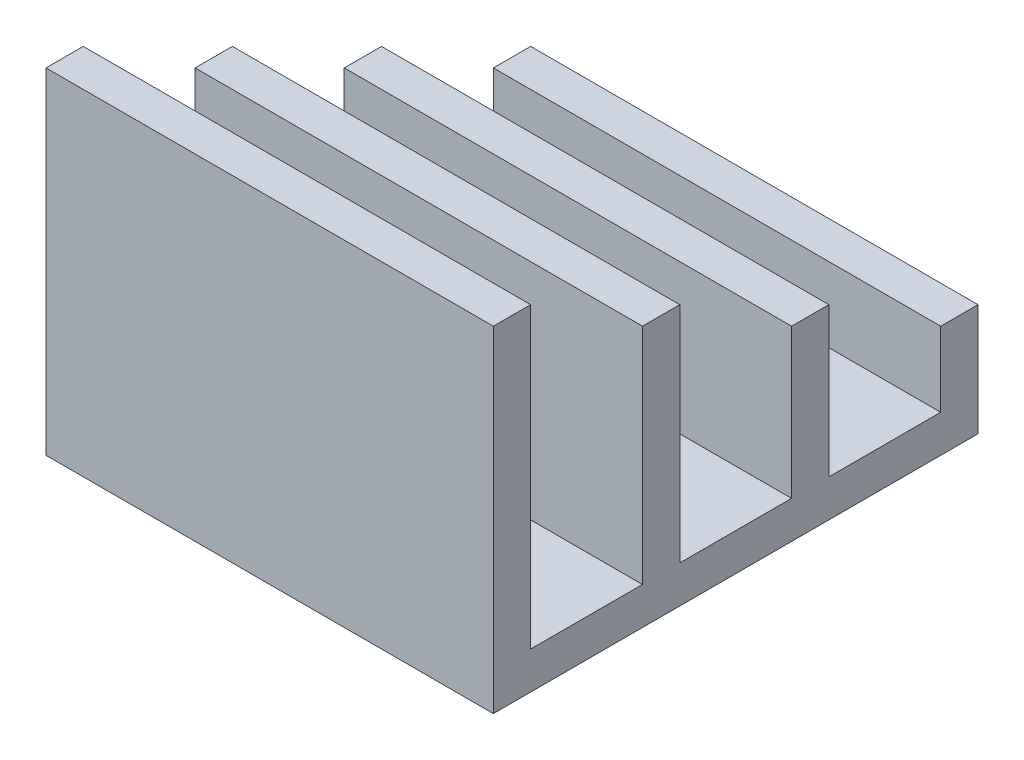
ISO-10303-21;
HEADER;
FILE_DESCRIPTION(('STEP AP214'),'2;1');
FILE_NAME('part.step','',(''),(''),'','','');
FILE_SCHEMA(('AUTOMOTIVE_DESIGN { 1 0 10303 214 1 1 1 1 }'));
ENDSEC;
DATA;
#1=APPLICATION_CONTEXT('core data for automotive mechanical design processes');
#2=APPLICATION_PROTOCOL_DEFINITION('international standard','automotive_design',2000,#1);
#3=PRODUCT_CONTEXT('',#1,'mechanical');
#4=PRODUCT('Part','Part','',(#3));
#5=PRODUCT_RELATED_PRODUCT_CATEGORY('part','',(#4));
#6=PRODUCT_DEFINITION_FORMATION('','',#4);
#7=PRODUCT_DEFINITION_CONTEXT('part definition',#1,'design');
#8=PRODUCT_DEFINITION('design','',#6,#7);
#9=PRODUCT_DEFINITION_SHAPE('','',#8);
#10=(LENGTH_UNIT() NAMED_UNIT(*) SI_UNIT(.MILLI.,.METRE.));
#11=(NAMED_UNIT(*) PLANE_ANGLE_UNIT() SI_UNIT($,.RADIAN.));
#12=(NAMED_UNIT(*) SI_UNIT($,.STERADIAN.) SOLID_ANGLE_UNIT());
#13=UNCERTAINTY_MEASURE_WITH_UNIT(LENGTH_MEASURE(1.E-05),#10,'distance_accuracy_value','');
#14=(GEOMETRIC_REPRESENTATION_CONTEXT(3) GLOBAL_UNCERTAINTY_ASSIGNED_CONTEXT((#13)) GLOBAL_UNIT_ASSIGNED_CONTEXT((#10,
#11,#12)) REPRESENTATION_CONTEXT('',''));
#15=CARTESIAN_POINT('',(0.,0.,0.));
#16=DIRECTION('',(0.,0.,1.));
#17=DIRECTION('',(1.,0.,0.));
#18=AXIS2_PLACEMENT_3D('',#15,#16,#17);
#19=CARTESIAN_POINT('',(152.4,0.,-165.1));
#20=DIRECTION('',(0.,1.,0.));
#21=DIRECTION('',(0.,0.,1.));
#22=AXIS2_PLACEMENT_3D('',#19,#20,#21);
#23=PLANE('',#22);
#24=DIRECTION('',(0.,0.,-1.));
#25=VECTOR('',#24,1.);
#26=CARTESIAN_POINT('',(0.,0.,-165.1));
#27=LINE('',#26,#25);
#28=CARTESIAN_POINT('',(0.,0.,0.));
#29=VERTEX_POINT('',#28);
#30=CARTESIAN_POINT('',(0.,0.,-165.1));
#31=VERTEX_POINT('',#30);
#32=EDGE_CURVE('E181',#29,#31,#27,.T.);
#33=ORIENTED_EDGE('',*,*,#32,.T.);
#34=DIRECTION('',(-1.,0.,0.));
#35=VECTOR('',#34,1.);
#36=CARTESIAN_POINT('',(152.4,0.,-165.1));
#37=LINE('',#36,#35);
#38=CARTESIAN_POINT('',(152.4,0.,-165.1));
#39=VERTEX_POINT('',#38);
#40=EDGE_CURVE('E11',#39,#31,#37,.T.);
#41=ORIENTED_EDGE('',*,*,#40,.F.);
#42=DIRECTION('',(0.,0.,-1.));
#43=VECTOR('',#42,1.);
#44=CARTESIAN_POINT('',(152.4,0.,-165.1));
#45=LINE('',#44,#43);
#46=CARTESIAN_POINT('',(152.4,0.,0.));
#47=VERTEX_POINT('',#46);
#48=EDGE_CURVE('E211',#47,#39,#45,.T.);
#49=ORIENTED_EDGE('',*,*,#48,.F.);
#50=DIRECTION('',(-1.,0.,0.));
#51=VECTOR('',#50,1.);
#52=CARTESIAN_POINT('',(152.4,0.,0.));
#53=LINE('',#52,#51);
#54=EDGE_CURVE('E177',#47,#29,#53,.T.);
#55=ORIENTED_EDGE('',*,*,#54,.T.);
#56=EDGE_LOOP('',(#33,#41,#49,#55));
#57=FACE_BOUND('',#56,.T.);
#58=ADVANCED_FACE('F37',(#57),#23,.F.);
#59=CARTESIAN_POINT('',(152.4,38.1,-165.1));
#60=DIRECTION('',(0.,0.,1.));
#61=DIRECTION('',(0.,-1.,0.));
#62=AXIS2_PLACEMENT_3D('',#59,#60,#61);
#63=PLANE('',#62);
#64=DIRECTION('',(0.,1.,0.));
#65=VECTOR('',#64,1.);
#66=CARTESIAN_POINT('',(0.,38.1,-165.1));
#67=LINE('',#66,#65);
#68=CARTESIAN_POINT('',(0.,38.1,-165.1));
#69=VERTEX_POINT('',#68);
#70=EDGE_CURVE('E184',#31,#69,#67,.T.);
#71=ORIENTED_EDGE('',*,*,#70,.T.);
#72=DIRECTION('',(-1.,0.,0.));
#73=VECTOR('',#72,1.);
#74=CARTESIAN_POINT('',(152.4,38.1,-165.1));
#75=LINE('',#74,#73);
#76=CARTESIAN_POINT('',(152.4,38.1,-165.1));
#77=VERTEX_POINT('',#76);
#78=EDGE_CURVE('E45',#77,#69,#75,.T.);
#79=ORIENTED_EDGE('',*,*,#78,.F.);
#80=DIRECTION('',(0.,1.,0.));
#81=VECTOR('',#80,1.);
#82=CARTESIAN_POINT('',(152.4,38.1,-165.1));
#83=LINE('',#82,#81);
#84=EDGE_CURVE('E120',#39,#77,#83,.T.);
#85=ORIENTED_EDGE('',*,*,#84,.F.);
#86=ORIENTED_EDGE('',*,*,#40,.T.);
#87=EDGE_LOOP('',(#71,#79,#85,#86));
#88=FACE_BOUND('',#87,.T.);
#89=ADVANCED_FACE('F309',(#88),#63,.F.);
#90=CARTESIAN_POINT('',(152.4,38.1,-152.4));
#91=DIRECTION('',(0.,-1.,0.));
#92=DIRECTION('',(0.,0.,-1.));
#93=AXIS2_PLACEMENT_3D('',#90,#91,#92);
#94=PLANE('',#93);
#95=DIRECTION('',(0.,0.,1.));
#96=VECTOR('',#95,1.);
#97=CARTESIAN_POINT('',(0.,38.1,-152.4));
#98=LINE('',#97,#96);
#99=CARTESIAN_POINT('',(0.,38.1,-152.4));
#100=VERTEX_POINT('',#99);
#101=EDGE_CURVE('E186',#69,#100,#98,.T.);
#102=ORIENTED_EDGE('',*,*,#101,.T.);
#103=DIRECTION('',(-1.,0.,0.));
#104=VECTOR('',#103,1.);
#105=CARTESIAN_POINT('',(152.4,38.1,-152.4));
#106=LINE('',#105,#104);
#107=CARTESIAN_POINT('',(152.4,38.1,-152.4));
#108=VERTEX_POINT('',#107);
#109=EDGE_CURVE('E242',#108,#100,#106,.T.);
#110=ORIENTED_EDGE('',*,*,#109,.F.);
#111=DIRECTION('',(0.,0.,1.));
#112=VECTOR('',#111,1.);
#113=CARTESIAN_POINT('',(152.4,38.1,-152.4));
#114=LINE('',#113,#112);
#115=EDGE_CURVE('E250',#77,#108,#114,.T.);
#116=ORIENTED_EDGE('',*,*,#115,.F.);
#117=ORIENTED_EDGE('',*,*,#78,.T.);
#118=EDGE_LOOP('',(#102,#110,#116,#117));
#119=FACE_BOUND('',#118,.T.);
#120=ADVANCED_FACE('F248',(#119),#94,.F.);
#121=CARTESIAN_POINT('',(152.4,12.7,-152.4));
#122=DIRECTION('',(0.,0.,-1.));
#123=DIRECTION('',(0.,1.,0.));
#124=AXIS2_PLACEMENT_3D('',#121,#122,#123);
#125=PLANE('',#124);
#126=DIRECTION('',(0.,-1.,0.));
#127=VECTOR('',#126,1.);
#128=CARTESIAN_POINT('',(0.,12.7,-152.4));
#129=LINE('',#128,#127);
#130=CARTESIAN_POINT('',(0.,12.7,-152.4));
#131=VERTEX_POINT('',#130);
#132=EDGE_CURVE('E188',#100,#131,#129,.T.);
#133=ORIENTED_EDGE('',*,*,#132,.T.);
#134=DIRECTION('',(-1.,0.,0.));
#135=VECTOR('',#134,1.);
#136=CARTESIAN_POINT('',(152.4,12.7,-152.4));
#137=LINE('',#136,#135);
#138=CARTESIAN_POINT('',(152.4,12.7,-152.4));
#139=VERTEX_POINT('',#138);
#140=EDGE_CURVE('E239',#139,#131,#137,.T.);
#141=ORIENTED_EDGE('',*,*,#140,.F.);
#142=DIRECTION('',(0.,-1.,0.));
#143=VECTOR('',#142,1.);
#144=CARTESIAN_POINT('',(152.4,12.7,-152.4));
#145=LINE('',#144,#143);
#146=EDGE_CURVE('E268',#108,#139,#145,.T.);
#147=ORIENTED_EDGE('',*,*,#146,.F.);
#148=ORIENTED_EDGE('',*,*,#109,.T.);
#149=EDGE_LOOP('',(#133,#141,#147,#148));
#150=FACE_BOUND('',#149,.T.);
#151=ADVANCED_FACE('F259',(#150),#125,.F.);
#152=CARTESIAN_POINT('',(152.4,12.7,-114.3));
#153=DIRECTION('',(0.,-1.,0.));
#154=DIRECTION('',(0.,0.,-1.));
#155=AXIS2_PLACEMENT_3D('',#152,#153,#154);
#156=PLANE('',#155);
#157=DIRECTION('',(0.,0.,1.));
#158=VECTOR('',#157,1.);
#159=CARTESIAN_POINT('',(0.,12.7,-114.3));
#160=LINE('',#159,#158);
#161=CARTESIAN_POINT('',(0.,12.7,-114.3));
#162=VERTEX_POINT('',#161);
#163=EDGE_CURVE('E190',#131,#162,#160,.T.);
#164=ORIENTED_EDGE('',*,*,#163,.T.);
#165=DIRECTION('',(-1.,0.,0.));
#166=VECTOR('',#165,1.);
#167=CARTESIAN_POINT('',(152.4,12.7,-114.3));
#168=LINE('',#167,#166);
#169=CARTESIAN_POINT('',(152.4,12.7,-114.3));
#170=VERTEX_POINT('',#169);
#171=EDGE_CURVE('E236',#170,#162,#168,.T.);
#172=ORIENTED_EDGE('',*,*,#171,.F.);
#173=DIRECTION('',(0.,0.,1.));
#174=VECTOR('',#173,1.);
#175=CARTESIAN_POINT('',(152.4,12.7,-114.3));
#176=LINE('',#175,#174);
#177=EDGE_CURVE('E265',#139,#170,#176,.T.);
#178=ORIENTED_EDGE('',*,*,#177,.F.);
#179=ORIENTED_EDGE('',*,*,#140,.T.);
#180=EDGE_LOOP('',(#164,#172,#178,#179));
#181=FACE_BOUND('',#180,.T.);
#182=ADVANCED_FACE('F263',(#181),#156,.F.);
#183=CARTESIAN_POINT('',(152.4,63.5,-114.3));
#184=DIRECTION('',(0.,0.,1.));
#185=DIRECTION('',(0.,-1.,0.));
#186=AXIS2_PLACEMENT_3D('',#183,#184,#185);
#187=PLANE('',#186);
#188=DIRECTION('',(0.,1.,0.));
#189=VECTOR('',#188,1.);
#190=CARTESIAN_POINT('',(0.,63.5,-114.3));
#191=LINE('',#190,#189);
#192=CARTESIAN_POINT('',(0.,63.5,-114.3));
#193=VERTEX_POINT('',#192);
#194=EDGE_CURVE('E192',#162,#193,#191,.T.);
#195=ORIENTED_EDGE('',*,*,#194,.T.);
#196=DIRECTION('',(-1.,0.,0.));
#197=VECTOR('',#196,1.);
#198=CARTESIAN_POINT('',(152.4,63.5,-114.3));
#199=LINE('',#198,#197);
#200=CARTESIAN_POINT('',(152.4,63.5,-114.3));
#201=VERTEX_POINT('',#200);
#202=EDGE_CURVE('E233',#201,#193,#199,.T.);
#203=ORIENTED_EDGE('',*,*,#202,.F.);
#204=DIRECTION('',(0.,1.,0.));
#205=VECTOR('',#204,1.);
#206=CARTESIAN_POINT('',(152.4,63.5,-114.3));
#207=LINE('',#206,#205);
#208=EDGE_CURVE('E267',#170,#201,#207,.T.);
#209=ORIENTED_EDGE('',*,*,#208,.F.);
#210=ORIENTED_EDGE('',*,*,#171,.T.);
#211=EDGE_LOOP('',(#195,#203,#209,#210));
#212=FACE_BOUND('',#211,.T.);
#213=ADVANCED_FACE('F322',(#212),#187,.F.);
#214=CARTESIAN_POINT('',(152.4,63.5,-101.6));
#215=DIRECTION('',(0.,-1.,0.));
#216=DIRECTION('',(0.,0.,-1.));
#217=AXIS2_PLACEMENT_3D('',#214,#215,#216);
#218=PLANE('',#217);
#219=DIRECTION('',(0.,0.,1.));
#220=VECTOR('',#219,1.);
#221=CARTESIAN_POINT('',(0.,63.5,-101.6));
#222=LINE('',#221,#220);
#223=CARTESIAN_POINT('',(0.,63.5,-101.6));
#224=VERTEX_POINT('',#223);
#225=EDGE_CURVE('E194',#193,#224,#222,.T.);
#226=ORIENTED_EDGE('',*,*,#225,.T.);
#227=DIRECTION('',(-1.,0.,0.));
#228=VECTOR('',#227,1.);
#229=CARTESIAN_POINT('',(152.4,63.5,-101.6));
#230=LINE('',#229,#228);
#231=CARTESIAN_POINT('',(152.4,63.5,-101.6));
#232=VERTEX_POINT('',#231);
#233=EDGE_CURVE('E230',#232,#224,#230,.T.);
#234=ORIENTED_EDGE('',*,*,#233,.F.);
#235=DIRECTION('',(0.,0.,1.));
#236=VECTOR('',#235,1.);
#237=CARTESIAN_POINT('',(152.4,63.5,-101.6));
#238=LINE('',#237,#236);
#239=EDGE_CURVE('E270',#201,#232,#238,.T.);
#240=ORIENTED_EDGE('',*,*,#239,.F.);
#241=ORIENTED_EDGE('',*,*,#202,.T.);
#242=EDGE_LOOP('',(#226,#234,#240,#241));
#243=FACE_BOUND('',#242,.T.);
#244=ADVANCED_FACE('F325',(#243),#218,.F.);
#245=CARTESIAN_POINT('',(152.4,12.7,-101.6));
#246=DIRECTION('',(0.,0.,-1.));
#247=DIRECTION('',(-1.,0.,0.));
#248=AXIS2_PLACEMENT_3D('',#245,#246,#247);
#249=PLANE('',#248);
#250=DIRECTION('',(0.,-1.,0.));
#251=VECTOR('',#250,1.);
#252=CARTESIAN_POINT('',(0.,12.7,-101.6));
#253=LINE('',#252,#251);
#254=CARTESIAN_POINT('',(0.,12.7,-101.6));
#255=VERTEX_POINT('',#254);
#256=EDGE_CURVE('E196',#224,#255,#253,.T.);
#257=ORIENTED_EDGE('',*,*,#256,.T.);
#258=DIRECTION('',(-1.,0.,0.));
#259=VECTOR('',#258,1.);
#260=CARTESIAN_POINT('',(152.4,12.7,-101.6));
#261=LINE('',#260,#259);
#262=CARTESIAN_POINT('',(152.4,12.7,-101.6));
#263=VERTEX_POINT('',#262);
#264=EDGE_CURVE('E227',#263,#255,#261,.T.);
#265=ORIENTED_EDGE('',*,*,#264,.F.);
#266=DIRECTION('',(0.,-1.,0.));
#267=VECTOR('',#266,1.);
#268=CARTESIAN_POINT('',(152.4,12.7,-101.6));
#269=LINE('',#268,#267);
#270=EDGE_CURVE('E276',#232,#263,#269,.T.);
#271=ORIENTED_EDGE('',*,*,#270,.F.);
#272=ORIENTED_EDGE('',*,*,#233,.T.);
#273=EDGE_LOOP('',(#257,#265,#271,#272));
#274=FACE_BOUND('',#273,.T.);
#275=ADVANCED_FACE('F329',(#274),#249,.F.);
#276=CARTESIAN_POINT('',(152.4,12.7,-63.5));
#277=DIRECTION('',(0.,-1.,0.));
#278=DIRECTION('',(0.,0.,-1.));
#279=AXIS2_PLACEMENT_3D('',#276,#277,#278);
#280=PLANE('',#279);
#281=DIRECTION('',(0.,0.,1.));
#282=VECTOR('',#281,1.);
#283=CARTESIAN_POINT('',(0.,12.7,-63.5));
#284=LINE('',#283,#282);
#285=CARTESIAN_POINT('',(0.,12.7,-63.5));
#286=VERTEX_POINT('',#285);
#287=EDGE_CURVE('E198',#255,#286,#284,.T.);
#288=ORIENTED_EDGE('',*,*,#287,.T.);
#289=DIRECTION('',(-1.,0.,0.));
#290=VECTOR('',#289,1.);
#291=CARTESIAN_POINT('',(152.4,12.7,-63.5));
#292=LINE('',#291,#290);
#293=CARTESIAN_POINT('',(152.4,12.7,-63.5));
#294=VERTEX_POINT('',#293);
#295=EDGE_CURVE('E224',#294,#286,#292,.T.);
#296=ORIENTED_EDGE('',*,*,#295,.F.);
#297=DIRECTION('',(0.,0.,1.));
#298=VECTOR('',#297,1.);
#299=CARTESIAN_POINT('',(152.4,12.7,-63.5));
#300=LINE('',#299,#298);
#301=EDGE_CURVE('E278',#263,#294,#300,.T.);
#302=ORIENTED_EDGE('',*,*,#301,.F.);
#303=ORIENTED_EDGE('',*,*,#264,.T.);
#304=EDGE_LOOP('',(#288,#296,#302,#303));
#305=FACE_BOUND('',#304,.T.);
#306=ADVANCED_FACE('F333',(#305),#280,.F.);
#307=CARTESIAN_POINT('',(152.4,88.9,-63.5));
#308=DIRECTION('',(0.,0.,1.));
#309=DIRECTION('',(0.,-1.,0.));
#310=AXIS2_PLACEMENT_3D('',#307,#308,#309);
#311=PLANE('',#310);
#312=DIRECTION('',(0.,1.,0.));
#313=VECTOR('',#312,1.);
#314=CARTESIAN_POINT('',(0.,88.9,-63.5));
#315=LINE('',#314,#313);
#316=CARTESIAN_POINT('',(0.,88.9,-63.5));
#317=VERTEX_POINT('',#316);
#318=EDGE_CURVE('E200',#286,#317,#315,.T.);
#319=ORIENTED_EDGE('',*,*,#318,.T.);
#320=DIRECTION('',(-1.,0.,0.));
#321=VECTOR('',#320,1.);
#322=CARTESIAN_POINT('',(152.4,88.9,-63.5));
#323=LINE('',#322,#321);
#324=CARTESIAN_POINT('',(152.4,88.9,-63.5));
#325=VERTEX_POINT('',#324);
#326=EDGE_CURVE('E221',#325,#317,#323,.T.);
#327=ORIENTED_EDGE('',*,*,#326,.F.);
#328=DIRECTION('',(0.,1.,0.));
#329=VECTOR('',#328,1.);
#330=CARTESIAN_POINT('',(152.4,88.9,-63.5));
#331=LINE('',#330,#329);
#332=EDGE_CURVE('E280',#294,#325,#331,.T.);
#333=ORIENTED_EDGE('',*,*,#332,.F.);
#334=ORIENTED_EDGE('',*,*,#295,.T.);
#335=EDGE_LOOP('',(#319,#327,#333,#334));
#336=FACE_BOUND('',#335,.T.);
#337=ADVANCED_FACE('F337',(#336),#311,.F.);
#338=CARTESIAN_POINT('',(152.4,88.9,-50.8));
#339=DIRECTION('',(0.,-1.,0.));
#340=DIRECTION('',(0.,0.,-1.));
#341=AXIS2_PLACEMENT_3D('',#338,#339,#340);
#342=PLANE('',#341);
#343=DIRECTION('',(0.,0.,1.));
#344=VECTOR('',#343,1.);
#345=CARTESIAN_POINT('',(0.,88.9,-50.8));
#346=LINE('',#345,#344);
#347=CARTESIAN_POINT('',(0.,88.9,-50.8));
#348=VERTEX_POINT('',#347);
#349=EDGE_CURVE('E202',#317,#348,#346,.T.);
#350=ORIENTED_EDGE('',*,*,#349,.T.);
#351=DIRECTION('',(-1.,0.,0.));
#352=VECTOR('',#351,1.);
#353=CARTESIAN_POINT('',(152.4,88.9,-50.8));
#354=LINE('',#353,#352);
#355=CARTESIAN_POINT('',(152.4,88.9,-50.8));
#356=VERTEX_POINT('',#355);
#357=EDGE_CURVE('E218',#356,#348,#354,.T.);
#358=ORIENTED_EDGE('',*,*,#357,.F.);
#359=DIRECTION('',(0.,0.,1.));
#360=VECTOR('',#359,1.);
#361=CARTESIAN_POINT('',(152.4,88.9,-50.8));
#362=LINE('',#361,#360);
#363=EDGE_CURVE('E282',#325,#356,#362,.T.);
#364=ORIENTED_EDGE('',*,*,#363,.F.);
#365=ORIENTED_EDGE('',*,*,#326,.T.);
#366=EDGE_LOOP('',(#350,#358,#364,#365));
#367=FACE_BOUND('',#366,.T.);
#368=ADVANCED_FACE('F341',(#367),#342,.F.);
#369=CARTESIAN_POINT('',(152.4,12.7,-50.8));
#370=DIRECTION('',(0.,0.,-1.));
#371=DIRECTION('',(-1.,0.,0.));
#372=AXIS2_PLACEMENT_3D('',#369,#370,#371);
#373=PLANE('',#372);
#374=DIRECTION('',(0.,-1.,0.));
#375=VECTOR('',#374,1.);
#376=CARTESIAN_POINT('',(0.,12.7,-50.8));
#377=LINE('',#376,#375);
#378=CARTESIAN_POINT('',(0.,12.7,-50.8));
#379=VERTEX_POINT('',#378);
#380=EDGE_CURVE('E204',#348,#379,#377,.T.);
#381=ORIENTED_EDGE('',*,*,#380,.T.);
#382=DIRECTION('',(-1.,0.,0.));
#383=VECTOR('',#382,1.);
#384=CARTESIAN_POINT('',(152.4,12.7,-50.8));
#385=LINE('',#384,#383);
#386=CARTESIAN_POINT('',(152.4,12.7,-50.8));
#387=VERTEX_POINT('',#386);
#388=EDGE_CURVE('E215',#387,#379,#385,.T.);
#389=ORIENTED_EDGE('',*,*,#388,.F.);
#390=DIRECTION('',(0.,-1.,0.));
#391=VECTOR('',#390,1.);
#392=CARTESIAN_POINT('',(152.4,12.7,-50.8));
#393=LINE('',#392,#391);
#394=EDGE_CURVE('E284',#356,#387,#393,.T.);
#395=ORIENTED_EDGE('',*,*,#394,.F.);
#396=ORIENTED_EDGE('',*,*,#357,.T.);
#397=EDGE_LOOP('',(#381,#389,#395,#396));
#398=FACE_BOUND('',#397,.T.);
#399=ADVANCED_FACE('F290',(#398),#373,.F.);
#400=CARTESIAN_POINT('',(152.4,12.7,-12.7));
#401=DIRECTION('',(0.,-1.,0.));
#402=DIRECTION('',(0.,0.,-1.));
#403=AXIS2_PLACEMENT_3D('',#400,#401,#402);
#404=PLANE('',#403);
#405=DIRECTION('',(0.,0.,1.));
#406=VECTOR('',#405,1.);
#407=CARTESIAN_POINT('',(0.,12.7,-12.7));
#408=LINE('',#407,#406);
#409=CARTESIAN_POINT('',(0.,12.7,-12.7));
#410=VERTEX_POINT('',#409);
#411=EDGE_CURVE('E206',#379,#410,#408,.T.);
#412=ORIENTED_EDGE('',*,*,#411,.T.);
#413=DIRECTION('',(-1.,0.,0.));
#414=VECTOR('',#413,1.);
#415=CARTESIAN_POINT('',(152.4,12.7,-12.7));
#416=LINE('',#415,#414);
#417=CARTESIAN_POINT('',(152.4,12.7,-12.7));
#418=VERTEX_POINT('',#417);
#419=EDGE_CURVE('E172',#418,#410,#416,.T.);
#420=ORIENTED_EDGE('',*,*,#419,.F.);
#421=DIRECTION('',(0.,0.,1.));
#422=VECTOR('',#421,1.);
#423=CARTESIAN_POINT('',(152.4,12.7,-12.7));
#424=LINE('',#423,#422);
#425=EDGE_CURVE('E163',#387,#418,#424,.T.);
#426=ORIENTED_EDGE('',*,*,#425,.F.);
#427=ORIENTED_EDGE('',*,*,#388,.T.);
#428=EDGE_LOOP('',(#412,#420,#426,#427));
#429=FACE_BOUND('',#428,.T.);
#430=ADVANCED_FACE('F294',(#429),#404,.F.);
#431=CARTESIAN_POINT('',(152.4,114.3,-12.7));
#432=DIRECTION('',(0.,0.,1.));
#433=DIRECTION('',(0.,-1.,0.));
#434=AXIS2_PLACEMENT_3D('',#431,#432,#433);
#435=PLANE('',#434);
#436=DIRECTION('',(0.,1.,0.));
#437=VECTOR('',#436,1.);
#438=CARTESIAN_POINT('',(0.,114.3,-12.7));
#439=LINE('',#438,#437);
#440=CARTESIAN_POINT('',(0.,114.3,-12.7));
#441=VERTEX_POINT('',#440);
#442=EDGE_CURVE('E171',#410,#441,#439,.T.);
#443=ORIENTED_EDGE('',*,*,#442,.T.);
#444=DIRECTION('',(-1.,0.,0.));
#445=VECTOR('',#444,1.);
#446=CARTESIAN_POINT('',(152.4,114.3,-12.7));
#447=LINE('',#446,#445);
#448=CARTESIAN_POINT('',(152.4,114.3,-12.7));
#449=VERTEX_POINT('',#448);
#450=EDGE_CURVE('E168',#449,#441,#447,.T.);
#451=ORIENTED_EDGE('',*,*,#450,.F.);
#452=DIRECTION('',(0.,1.,0.));
#453=VECTOR('',#452,1.);
#454=CARTESIAN_POINT('',(152.4,114.3,-12.7));
#455=LINE('',#454,#453);
#456=EDGE_CURVE('E157',#418,#449,#455,.T.);
#457=ORIENTED_EDGE('',*,*,#456,.F.);
#458=ORIENTED_EDGE('',*,*,#419,.T.);
#459=EDGE_LOOP('',(#443,#451,#457,#458));
#460=FACE_BOUND('',#459,.T.);
#461=ADVANCED_FACE('F169',(#460),#435,.F.);
#462=CARTESIAN_POINT('',(152.4,114.3,0.));
#463=DIRECTION('',(0.,-1.,0.));
#464=DIRECTION('',(0.,0.,-1.));
#465=AXIS2_PLACEMENT_3D('',#462,#463,#464);
#466=PLANE('',#465);
#467=DIRECTION('',(0.,0.,1.));
#468=VECTOR('',#467,1.);
#469=CARTESIAN_POINT('',(0.,114.3,0.));
#470=LINE('',#469,#468);
#471=CARTESIAN_POINT('',(0.,114.3,0.));
#472=VERTEX_POINT('',#471);
#473=EDGE_CURVE('E106',#441,#472,#470,.T.);
#474=ORIENTED_EDGE('',*,*,#473,.T.);
#475=DIRECTION('',(-1.,0.,0.));
#476=VECTOR('',#475,1.);
#477=CARTESIAN_POINT('',(152.4,114.3,0.));
#478=LINE('',#477,#476);
#479=CARTESIAN_POINT('',(152.4,114.3,0.));
#480=VERTEX_POINT('',#479);
#481=EDGE_CURVE('E173',#480,#472,#478,.T.);
#482=ORIENTED_EDGE('',*,*,#481,.F.);
#483=DIRECTION('',(0.,0.,1.));
#484=VECTOR('',#483,1.);
#485=CARTESIAN_POINT('',(152.4,114.3,0.));
#486=LINE('',#485,#484);
#487=EDGE_CURVE('E161',#449,#480,#486,.T.);
#488=ORIENTED_EDGE('',*,*,#487,.F.);
#489=ORIENTED_EDGE('',*,*,#450,.T.);
#490=EDGE_LOOP('',(#474,#482,#488,#489));
#491=FACE_BOUND('',#490,.T.);
#492=ADVANCED_FACE('F175',(#491),#466,.F.);
#493=CARTESIAN_POINT('',(152.4,0.,0.));
#494=DIRECTION('',(0.,0.,-1.));
#495=DIRECTION('',(-1.,0.,0.));
#496=AXIS2_PLACEMENT_3D('',#493,#494,#495);
#497=PLANE('',#496);
#498=DIRECTION('',(0.,-1.,0.));
#499=VECTOR('',#498,1.);
#500=CARTESIAN_POINT('',(0.,0.,0.));
#501=LINE('',#500,#499);
#502=EDGE_CURVE('E112',#472,#29,#501,.T.);
#503=ORIENTED_EDGE('',*,*,#502,.T.);
#504=ORIENTED_EDGE('',*,*,#54,.F.);
#505=DIRECTION('',(0.,-1.,0.));
#506=VECTOR('',#505,1.);
#507=CARTESIAN_POINT('',(152.4,0.,0.));
#508=LINE('',#507,#506);
#509=EDGE_CURVE('E53',#480,#47,#508,.T.);
#510=ORIENTED_EDGE('',*,*,#509,.F.);
#511=ORIENTED_EDGE('',*,*,#481,.T.);
#512=EDGE_LOOP('',(#503,#504,#510,#511));
#513=FACE_BOUND('',#512,.T.);
#514=ADVANCED_FACE('F298',(#513),#497,.F.);
#515=CARTESIAN_POINT('',(152.4,0.,0.));
#516=DIRECTION('',(-1.,0.,0.));
#517=DIRECTION('',(0.,0.,1.));
#518=AXIS2_PLACEMENT_3D('',#515,#516,#517);
#519=PLANE('',#518);
#520=ORIENTED_EDGE('',*,*,#48,.T.);
#521=ORIENTED_EDGE('',*,*,#84,.T.);
#522=ORIENTED_EDGE('',*,*,#115,.T.);
#523=ORIENTED_EDGE('',*,*,#146,.T.);
#524=ORIENTED_EDGE('',*,*,#177,.T.);
#525=ORIENTED_EDGE('',*,*,#208,.T.);
#526=ORIENTED_EDGE('',*,*,#239,.T.);
#527=ORIENTED_EDGE('',*,*,#270,.T.);
#528=ORIENTED_EDGE('',*,*,#301,.T.);
#529=ORIENTED_EDGE('',*,*,#332,.T.);
#530=ORIENTED_EDGE('',*,*,#363,.T.);
#531=ORIENTED_EDGE('',*,*,#394,.T.);
#532=ORIENTED_EDGE('',*,*,#425,.T.);
#533=ORIENTED_EDGE('',*,*,#456,.T.);
#534=ORIENTED_EDGE('',*,*,#487,.T.);
#535=ORIENTED_EDGE('',*,*,#509,.T.);
#536=EDGE_LOOP('',(#520,#521,#522,#523,#524,#525,#526,#527,#528,#529,#530,#531,#532,#533,#534,#535));
#537=FACE_BOUND('',#536,.T.);
#538=ADVANCED_FACE('F159',(#537),#519,.F.);
#539=CARTESIAN_POINT('',(0.,0.,0.));
#540=DIRECTION('',(-1.,0.,0.));
#541=DIRECTION('',(0.,0.,1.));
#542=AXIS2_PLACEMENT_3D('',#539,#540,#541);
#543=PLANE('',#542);
#544=ORIENTED_EDGE('',*,*,#32,.F.);
#545=ORIENTED_EDGE('',*,*,#502,.F.);
#546=ORIENTED_EDGE('',*,*,#473,.F.);
#547=ORIENTED_EDGE('',*,*,#442,.F.);
#548=ORIENTED_EDGE('',*,*,#411,.F.);
#549=ORIENTED_EDGE('',*,*,#380,.F.);
#550=ORIENTED_EDGE('',*,*,#349,.F.);
#551=ORIENTED_EDGE('',*,*,#318,.F.);
#552=ORIENTED_EDGE('',*,*,#287,.F.);
#553=ORIENTED_EDGE('',*,*,#256,.F.);
#554=ORIENTED_EDGE('',*,*,#225,.F.);
#555=ORIENTED_EDGE('',*,*,#194,.F.);
#556=ORIENTED_EDGE('',*,*,#163,.F.);
#557=ORIENTED_EDGE('',*,*,#132,.F.);
#558=ORIENTED_EDGE('',*,*,#101,.F.);
#559=ORIENTED_EDGE('',*,*,#70,.F.);
#560=EDGE_LOOP('',(#544,#545,#546,#547,#548,#549,#550,#551,#552,#553,#554,#555,#556,#557,#558,#559));
#561=FACE_BOUND('',#560,.T.);
#562=ADVANCED_FACE('F254',(#561),#543,.T.);
#563=CLOSED_SHELL('',(#58,#89,#120,#151,#182,#213,#244,#275,#306,#337,#368,#399,#430,#461,#492,
#514,#538,#562));
#564=MANIFOLD_SOLID_BREP('B2',#563);
#565=ADVANCED_BREP_SHAPE_REPRESENTATION('',(#18,#564),#14);
#566=SHAPE_DEFINITION_REPRESENTATION(#9,#565);
ENDSEC;
END-ISO-10303-21;
